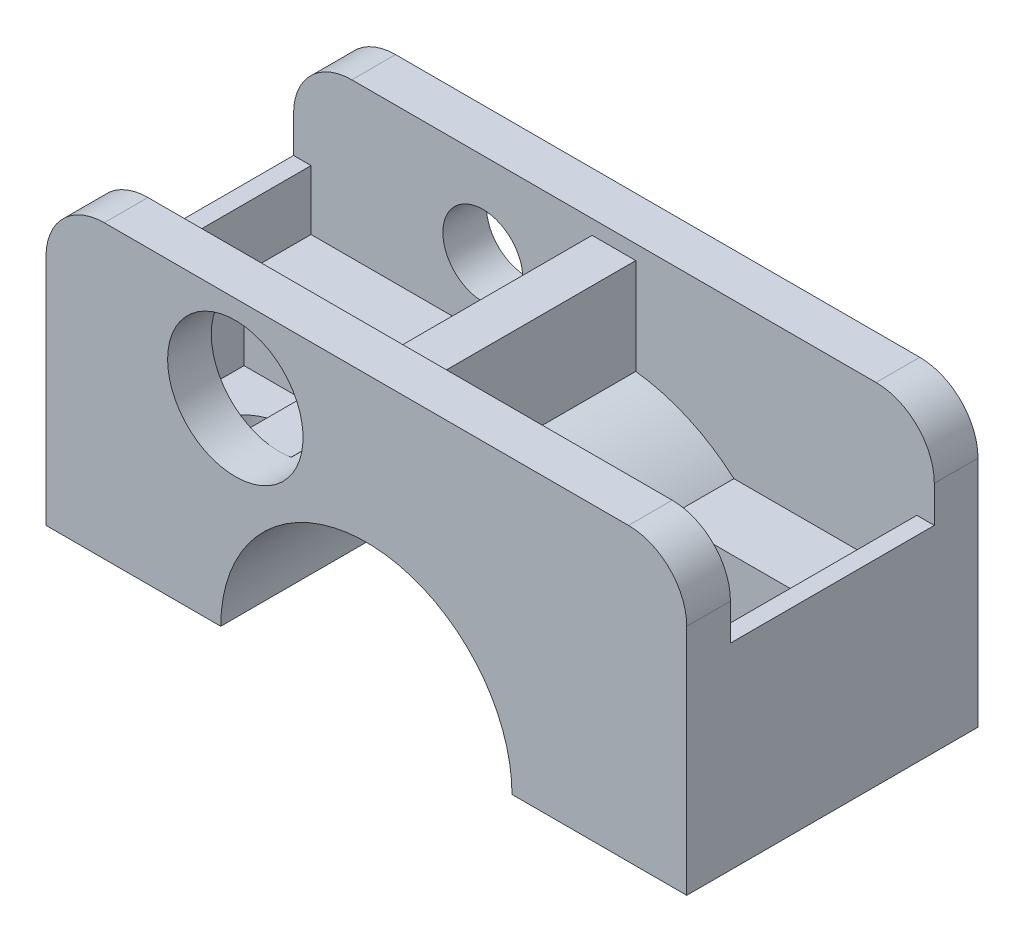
ISO-10303-21;
HEADER;
FILE_DESCRIPTION(('STEP AP214'),'2;1');
FILE_NAME('part.step','',(''),(''),'','','');
FILE_SCHEMA(('AUTOMOTIVE_DESIGN { 1 0 10303 214 1 1 1 1 }'));
ENDSEC;
DATA;
#1=APPLICATION_CONTEXT('core data for automotive mechanical design processes');
#2=APPLICATION_PROTOCOL_DEFINITION('international standard','automotive_design',2000,#1);
#3=PRODUCT_CONTEXT('',#1,'mechanical');
#4=PRODUCT('Part','Part','',(#3));
#5=PRODUCT_RELATED_PRODUCT_CATEGORY('part','',(#4));
#6=PRODUCT_DEFINITION_FORMATION('','',#4);
#7=PRODUCT_DEFINITION_CONTEXT('part definition',#1,'design');
#8=PRODUCT_DEFINITION('design','',#6,#7);
#9=PRODUCT_DEFINITION_SHAPE('','',#8);
#10=(LENGTH_UNIT() NAMED_UNIT(*) SI_UNIT(.MILLI.,.METRE.));
#11=(NAMED_UNIT(*) PLANE_ANGLE_UNIT() SI_UNIT($,.RADIAN.));
#12=(NAMED_UNIT(*) SI_UNIT($,.STERADIAN.) SOLID_ANGLE_UNIT());
#13=UNCERTAINTY_MEASURE_WITH_UNIT(LENGTH_MEASURE(1.E-05),#10,'distance_accuracy_value','');
#14=(GEOMETRIC_REPRESENTATION_CONTEXT(3) GLOBAL_UNCERTAINTY_ASSIGNED_CONTEXT((#13)) GLOBAL_UNIT_ASSIGNED_CONTEXT((#10,
#11,#12)) REPRESENTATION_CONTEXT('',''));
#15=CARTESIAN_POINT('',(0.,0.,0.));
#16=DIRECTION('',(0.,0.,1.));
#17=DIRECTION('',(1.,0.,0.));
#18=AXIS2_PLACEMENT_3D('',#15,#16,#17);
#19=CARTESIAN_POINT('',(0.,15.1140334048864,7.));
#20=DIRECTION('',(0.,0.,1.));
#21=DIRECTION('',(1.,0.,0.));
#22=AXIS2_PLACEMENT_3D('',#19,#20,#21);
#23=PLANE('',#22);
#24=CARTESIAN_POINT('',(0.,0.,7.));
#25=DIRECTION('',(0.,0.,1.));
#26=DIRECTION('',(1.,0.,0.));
#27=AXIS2_PLACEMENT_3D('',#24,#25,#26);
#28=CIRCLE('',#27,12.5);
#29=CARTESIAN_POINT('',(-8.23953882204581,9.39999999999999,7.));
#30=VERTEX_POINT('',#29);
#31=CARTESIAN_POINT('',(-8.14909297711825,9.47851695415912,7.));
#32=VERTEX_POINT('',#31);
#33=EDGE_CURVE('E221',#30,#32,#28,.F.);
#34=ORIENTED_EDGE('',*,*,#33,.F.);
#35=DIRECTION('',(1.,0.,0.));
#36=VECTOR('',#35,1.);
#37=CARTESIAN_POINT('',(-8.23953882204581,9.39999999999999,7.));
#38=LINE('',#37,#36);
#39=CARTESIAN_POINT('',(-9.,9.39999999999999,7.));
#40=VERTEX_POINT('',#39);
#41=EDGE_CURVE('E254',#30,#40,#38,.F.);
#42=ORIENTED_EDGE('',*,*,#41,.T.);
#43=CARTESIAN_POINT('',(-9.,14.05,7.));
#44=DIRECTION('',(0.,0.,-1.));
#45=DIRECTION('',(-1.,0.,0.));
#46=AXIS2_PLACEMENT_3D('',#43,#44,#45);
#47=CIRCLE('',#46,4.65);
#48=EDGE_CURVE('E340',#40,#32,#47,.F.);
#49=ORIENTED_EDGE('',*,*,#48,.T.);
#50=EDGE_LOOP('',(#34,#42,#49));
#51=FACE_BOUND('',#50,.T.);
#52=ADVANCED_FACE('F15',(#51),#23,.F.);
#53=CARTESIAN_POINT('',(0.,0.,-7.));
#54=DIRECTION('',(0.,0.,1.));
#55=DIRECTION('',(1.,0.,0.));
#56=AXIS2_PLACEMENT_3D('',#53,#54,#55);
#57=CYLINDRICAL_SURFACE('',#56,12.5);
#58=DIRECTION('',(0.,0.,-1.));
#59=VECTOR('',#58,1.);
#60=CARTESIAN_POINT('',(-8.23953882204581,9.39999999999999,-7.));
#61=LINE('',#60,#59);
#62=CARTESIAN_POINT('',(-8.23953882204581,9.39999999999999,-7.));
#63=VERTEX_POINT('',#62);
#64=EDGE_CURVE('E253',#63,#30,#61,.F.);
#65=ORIENTED_EDGE('',*,*,#64,.T.);
#66=ORIENTED_EDGE('',*,*,#33,.T.);
#67=DIRECTION('',(0.,0.,-1.));
#68=VECTOR('',#67,1.);
#69=CARTESIAN_POINT('',(-8.14909297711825,9.47851695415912,10.));
#70=LINE('',#69,#68);
#71=CARTESIAN_POINT('',(-8.14909297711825,9.47851695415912,-7.));
#72=VERTEX_POINT('',#71);
#73=EDGE_CURVE('E342',#32,#72,#70,.T.);
#74=ORIENTED_EDGE('',*,*,#73,.T.);
#75=CARTESIAN_POINT('',(0.,0.,-7.));
#76=DIRECTION('',(0.,0.,1.));
#77=DIRECTION('',(1.,0.,0.));
#78=AXIS2_PLACEMENT_3D('',#75,#76,#77);
#79=CIRCLE('',#78,12.5);
#80=EDGE_CURVE('E18',#72,#63,#79,.T.);
#81=ORIENTED_EDGE('',*,*,#80,.T.);
#82=EDGE_LOOP('',(#65,#66,#74,#81));
#83=FACE_BOUND('',#82,.T.);
#84=ADVANCED_FACE('F345',(#83),#57,.T.);
#85=CARTESIAN_POINT('',(20.8,9.39999999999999,-2.4));
#86=DIRECTION('',(0.,0.,-1.));
#87=DIRECTION('',(-1.,0.,0.));
#88=AXIS2_PLACEMENT_3D('',#85,#86,#87);
#89=PLANE('',#88);
#90=DIRECTION('',(0.,1.,0.));
#91=VECTOR('',#90,1.);
#92=CARTESIAN_POINT('',(20.8,13.5,-2.4));
#93=LINE('',#92,#91);
#94=CARTESIAN_POINT('',(20.8,3.89999999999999,-2.4));
#95=VERTEX_POINT('',#94);
#96=CARTESIAN_POINT('',(20.8,9.39999999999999,-2.4));
#97=VERTEX_POINT('',#96);
#98=EDGE_CURVE('E236',#95,#97,#93,.T.);
#99=ORIENTED_EDGE('',*,*,#98,.T.);
#100=DIRECTION('',(1.,0.,0.));
#101=VECTOR('',#100,1.);
#102=CARTESIAN_POINT('',(20.8,9.39999999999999,-2.4));
#103=LINE('',#102,#101);
#104=CARTESIAN_POINT('',(11.4,9.39999999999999,-2.4));
#105=VERTEX_POINT('',#104);
#106=EDGE_CURVE('E227',#97,#105,#103,.F.);
#107=ORIENTED_EDGE('',*,*,#106,.T.);
#108=DIRECTION('',(0.,1.,0.));
#109=VECTOR('',#108,1.);
#110=CARTESIAN_POINT('',(11.4,9.39999999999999,-2.4));
#111=LINE('',#110,#109);
#112=CARTESIAN_POINT('',(11.4,3.89999999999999,-2.4));
#113=VERTEX_POINT('',#112);
#114=EDGE_CURVE('E211',#105,#113,#111,.F.);
#115=ORIENTED_EDGE('',*,*,#114,.T.);
#116=DIRECTION('',(1.,0.,0.));
#117=VECTOR('',#116,1.);
#118=CARTESIAN_POINT('',(16.1,3.89999999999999,-2.4));
#119=LINE('',#118,#117);
#120=EDGE_CURVE('E248',#95,#113,#119,.F.);
#121=ORIENTED_EDGE('',*,*,#120,.F.);
#122=EDGE_LOOP('',(#99,#107,#115,#121));
#123=FACE_BOUND('',#122,.T.);
#124=ADVANCED_FACE('F234',(#123),#89,.F.);
#125=CARTESIAN_POINT('',(-11.4,9.39999999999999,-2.4));
#126=DIRECTION('',(0.,0.,-1.));
#127=DIRECTION('',(-1.,0.,0.));
#128=AXIS2_PLACEMENT_3D('',#125,#126,#127);
#129=PLANE('',#128);
#130=DIRECTION('',(0.,1.,0.));
#131=VECTOR('',#130,1.);
#132=CARTESIAN_POINT('',(-11.4,9.39999999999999,-2.4));
#133=LINE('',#132,#131);
#134=CARTESIAN_POINT('',(-11.4,3.89999999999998,-2.4));
#135=VERTEX_POINT('',#134);
#136=CARTESIAN_POINT('',(-11.4,9.39999999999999,-2.4));
#137=VERTEX_POINT('',#136);
#138=EDGE_CURVE('E220',#135,#137,#133,.T.);
#139=ORIENTED_EDGE('',*,*,#138,.T.);
#140=DIRECTION('',(1.,0.,0.));
#141=VECTOR('',#140,1.);
#142=CARTESIAN_POINT('',(-8.23953882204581,9.39999999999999,-2.4));
#143=LINE('',#142,#141);
#144=CARTESIAN_POINT('',(-20.8,9.39999999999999,-2.4));
#145=VERTEX_POINT('',#144);
#146=EDGE_CURVE('E343',#137,#145,#143,.F.);
#147=ORIENTED_EDGE('',*,*,#146,.T.);
#148=DIRECTION('',(0.,1.,0.));
#149=VECTOR('',#148,1.);
#150=CARTESIAN_POINT('',(-20.8,9.39999999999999,-2.4));
#151=LINE('',#150,#149);
#152=CARTESIAN_POINT('',(-20.8,3.89999999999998,-2.4));
#153=VERTEX_POINT('',#152);
#154=EDGE_CURVE('E445',#145,#153,#151,.F.);
#155=ORIENTED_EDGE('',*,*,#154,.T.);
#156=DIRECTION('',(1.,0.,0.));
#157=VECTOR('',#156,1.);
#158=CARTESIAN_POINT('',(-16.1,3.89999999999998,-2.4));
#159=LINE('',#158,#157);
#160=EDGE_CURVE('E249',#135,#153,#159,.F.);
#161=ORIENTED_EDGE('',*,*,#160,.F.);
#162=EDGE_LOOP('',(#139,#147,#155,#161));
#163=FACE_BOUND('',#162,.T.);
#164=ADVANCED_FACE('F461',(#163),#129,.F.);
#165=CARTESIAN_POINT('',(11.4,9.39999999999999,-2.4));
#166=DIRECTION('',(-1.,0.,0.));
#167=DIRECTION('',(0.,0.,1.));
#168=AXIS2_PLACEMENT_3D('',#165,#166,#167);
#169=PLANE('',#168);
#170=ORIENTED_EDGE('',*,*,#114,.F.);
#171=DIRECTION('',(0.,0.,-1.));
#172=VECTOR('',#171,1.);
#173=CARTESIAN_POINT('',(11.4,9.39999999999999,-7.));
#174=LINE('',#173,#172);
#175=CARTESIAN_POINT('',(11.4,9.39999999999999,7.));
#176=VERTEX_POINT('',#175);
#177=EDGE_CURVE('E215',#105,#176,#174,.F.);
#178=ORIENTED_EDGE('',*,*,#177,.T.);
#179=DIRECTION('',(0.,1.,0.));
#180=VECTOR('',#179,1.);
#181=CARTESIAN_POINT('',(11.4,15.1140334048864,7.));
#182=LINE('',#181,#180);
#183=CARTESIAN_POINT('',(11.4,3.89999999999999,7.));
#184=VERTEX_POINT('',#183);
#185=EDGE_CURVE('E382',#176,#184,#182,.F.);
#186=ORIENTED_EDGE('',*,*,#185,.T.);
#187=DIRECTION('',(0.,0.,1.));
#188=VECTOR('',#187,1.);
#189=CARTESIAN_POINT('',(11.4,3.89999999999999,2.3));
#190=LINE('',#189,#188);
#191=EDGE_CURVE('E217',#113,#184,#190,.T.);
#192=ORIENTED_EDGE('',*,*,#191,.F.);
#193=EDGE_LOOP('',(#170,#178,#186,#192));
#194=FACE_BOUND('',#193,.T.);
#195=ADVANCED_FACE('F213',(#194),#169,.F.);
#196=CARTESIAN_POINT('',(-11.4,9.39999999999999,7.));
#197=DIRECTION('',(1.,0.,0.));
#198=DIRECTION('',(0.,0.,-1.));
#199=AXIS2_PLACEMENT_3D('',#196,#197,#198);
#200=PLANE('',#199);
#201=DIRECTION('',(0.,1.,0.));
#202=VECTOR('',#201,1.);
#203=CARTESIAN_POINT('',(-11.4,15.1140334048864,7.));
#204=LINE('',#203,#202);
#205=CARTESIAN_POINT('',(-11.4,3.89999999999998,7.));
#206=VERTEX_POINT('',#205);
#207=CARTESIAN_POINT('',(-11.4,9.39999999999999,7.));
#208=VERTEX_POINT('',#207);
#209=EDGE_CURVE('E371',#206,#208,#204,.T.);
#210=ORIENTED_EDGE('',*,*,#209,.T.);
#211=DIRECTION('',(0.,0.,-1.));
#212=VECTOR('',#211,1.);
#213=CARTESIAN_POINT('',(-11.4,9.39999999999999,-7.));
#214=LINE('',#213,#212);
#215=EDGE_CURVE('E359',#208,#137,#214,.T.);
#216=ORIENTED_EDGE('',*,*,#215,.T.);
#217=ORIENTED_EDGE('',*,*,#138,.F.);
#218=DIRECTION('',(0.,0.,1.));
#219=VECTOR('',#218,1.);
#220=CARTESIAN_POINT('',(-11.4,3.89999999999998,2.3));
#221=LINE('',#220,#219);
#222=EDGE_CURVE('E252',#206,#135,#221,.F.);
#223=ORIENTED_EDGE('',*,*,#222,.F.);
#224=EDGE_LOOP('',(#210,#216,#217,#223));
#225=FACE_BOUND('',#224,.T.);
#226=ADVANCED_FACE('F707',(#225),#200,.F.);
#227=CARTESIAN_POINT('',(-16.1,3.89999999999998,2.3));
#228=DIRECTION('',(0.,1.,0.));
#229=DIRECTION('',(0.,0.,1.));
#230=AXIS2_PLACEMENT_3D('',#227,#228,#229);
#231=PLANE('',#230);
#232=CARTESIAN_POINT('',(-16.,3.89999999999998,2.5));
#233=DIRECTION('',(0.,1.,0.));
#234=DIRECTION('',(-1.,0.,0.));
#235=AXIS2_PLACEMENT_3D('',#232,#233,#234);
#236=CIRCLE('',#235,2.725);
#237=CARTESIAN_POINT('',(-18.725,3.89999999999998,2.5));
#238=VERTEX_POINT('',#237);
#239=EDGE_CURVE('E314',#238,#238,#236,.F.);
#240=ORIENTED_EDGE('',*,*,#239,.T.);
#241=EDGE_LOOP('',(#240));
#242=FACE_BOUND('',#241,.T.);
#243=DIRECTION('',(0.,0.,1.));
#244=VECTOR('',#243,1.);
#245=CARTESIAN_POINT('',(-20.8,3.89999999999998,-7.));
#246=LINE('',#245,#244);
#247=CARTESIAN_POINT('',(-20.8,3.89999999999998,7.));
#248=VERTEX_POINT('',#247);
#249=EDGE_CURVE('E416',#153,#248,#246,.T.);
#250=ORIENTED_EDGE('',*,*,#249,.T.);
#251=DIRECTION('',(1.,0.,0.));
#252=VECTOR('',#251,1.);
#253=CARTESIAN_POINT('',(0.,3.89999999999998,7.));
#254=LINE('',#253,#252);
#255=EDGE_CURVE('E373',#248,#206,#254,.T.);
#256=ORIENTED_EDGE('',*,*,#255,.T.);
#257=ORIENTED_EDGE('',*,*,#222,.T.);
#258=ORIENTED_EDGE('',*,*,#160,.T.);
#259=EDGE_LOOP('',(#250,#256,#257,#258));
#260=FACE_BOUND('',#259,.T.);
#261=ADVANCED_FACE('F704',(#242,#260),#231,.T.);
#262=CARTESIAN_POINT('',(-18.,20.,0.));
#263=DIRECTION('',(0.,1.,0.));
#264=DIRECTION('',(0.,0.,1.));
#265=AXIS2_PLACEMENT_3D('',#262,#263,#264);
#266=PLANE('',#265);
#267=DIRECTION('',(1.,0.,0.));
#268=VECTOR('',#267,1.);
#269=CARTESIAN_POINT('',(0.,20.,10.));
#270=LINE('',#269,#268);
#271=CARTESIAN_POINT('',(18.,20.,10.));
#272=VERTEX_POINT('',#271);
#273=CARTESIAN_POINT('',(-18.,20.,10.));
#274=VERTEX_POINT('',#273);
#275=EDGE_CURVE('E310',#272,#274,#270,.F.);
#276=ORIENTED_EDGE('',*,*,#275,.F.);
#277=DIRECTION('',(0.,0.,1.));
#278=VECTOR('',#277,1.);
#279=CARTESIAN_POINT('',(18.,20.,0.));
#280=LINE('',#279,#278);
#281=CARTESIAN_POINT('',(18.,20.,7.));
#282=VERTEX_POINT('',#281);
#283=EDGE_CURVE('E339',#282,#272,#280,.T.);
#284=ORIENTED_EDGE('',*,*,#283,.F.);
#285=DIRECTION('',(1.,0.,0.));
#286=VECTOR('',#285,1.);
#287=CARTESIAN_POINT('',(0.,20.,7.));
#288=LINE('',#287,#286);
#289=CARTESIAN_POINT('',(-18.,20.,7.));
#290=VERTEX_POINT('',#289);
#291=EDGE_CURVE('E329',#282,#290,#288,.F.);
#292=ORIENTED_EDGE('',*,*,#291,.T.);
#293=DIRECTION('',(0.,0.,1.));
#294=VECTOR('',#293,1.);
#295=CARTESIAN_POINT('',(-18.,20.,0.));
#296=LINE('',#295,#294);
#297=EDGE_CURVE('E317',#274,#290,#296,.F.);
#298=ORIENTED_EDGE('',*,*,#297,.F.);
#299=EDGE_LOOP('',(#276,#284,#292,#298));
#300=FACE_BOUND('',#299,.T.);
#301=ADVANCED_FACE('F700',(#300),#266,.T.);
#302=CARTESIAN_POINT('',(16.1,3.89999999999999,2.3));
#303=DIRECTION('',(0.,1.,0.));
#304=DIRECTION('',(0.,0.,1.));
#305=AXIS2_PLACEMENT_3D('',#302,#303,#304);
#306=PLANE('',#305);
#307=CARTESIAN_POINT('',(16.,3.89999999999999,2.5));
#308=DIRECTION('',(0.,1.,0.));
#309=DIRECTION('',(-1.,0.,0.));
#310=AXIS2_PLACEMENT_3D('',#307,#308,#309);
#311=CIRCLE('',#310,2.725);
#312=CARTESIAN_POINT('',(13.275,3.89999999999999,2.5));
#313=VERTEX_POINT('',#312);
#314=EDGE_CURVE('E302',#313,#313,#311,.F.);
#315=ORIENTED_EDGE('',*,*,#314,.T.);
#316=EDGE_LOOP('',(#315));
#317=FACE_BOUND('',#316,.T.);
#318=DIRECTION('',(1.,0.,0.));
#319=VECTOR('',#318,1.);
#320=CARTESIAN_POINT('',(0.,3.89999999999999,7.));
#321=LINE('',#320,#319);
#322=CARTESIAN_POINT('',(20.8,3.89999999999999,7.));
#323=VERTEX_POINT('',#322);
#324=EDGE_CURVE('E448',#184,#323,#321,.T.);
#325=ORIENTED_EDGE('',*,*,#324,.T.);
#326=DIRECTION('',(0.,0.,-1.));
#327=VECTOR('',#326,1.);
#328=CARTESIAN_POINT('',(20.8,3.89999999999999,-7.));
#329=LINE('',#328,#327);
#330=EDGE_CURVE('E231',#323,#95,#329,.T.);
#331=ORIENTED_EDGE('',*,*,#330,.T.);
#332=ORIENTED_EDGE('',*,*,#120,.T.);
#333=ORIENTED_EDGE('',*,*,#191,.T.);
#334=EDGE_LOOP('',(#325,#331,#332,#333));
#335=FACE_BOUND('',#334,.T.);
#336=ADVANCED_FACE('F495',(#317,#335),#306,.T.);
#337=CARTESIAN_POINT('',(-8.23953882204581,9.39999999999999,-7.));
#338=DIRECTION('',(0.,-1.,0.));
#339=DIRECTION('',(0.,0.,-1.));
#340=AXIS2_PLACEMENT_3D('',#337,#338,#339);
#341=PLANE('',#340);
#342=ORIENTED_EDGE('',*,*,#215,.F.);
#343=DIRECTION('',(1.,0.,0.));
#344=VECTOR('',#343,1.);
#345=CARTESIAN_POINT('',(0.,9.39999999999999,7.));
#346=LINE('',#345,#344);
#347=EDGE_CURVE('E325',#208,#40,#346,.T.);
#348=ORIENTED_EDGE('',*,*,#347,.T.);
#349=ORIENTED_EDGE('',*,*,#41,.F.);
#350=ORIENTED_EDGE('',*,*,#64,.F.);
#351=DIRECTION('',(1.,0.,0.));
#352=VECTOR('',#351,1.);
#353=CARTESIAN_POINT('',(0.,9.39999999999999,-7.));
#354=LINE('',#353,#352);
#355=CARTESIAN_POINT('',(-20.8,9.39999999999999,-7.));
#356=VERTEX_POINT('',#355);
#357=EDGE_CURVE('E244',#356,#63,#354,.T.);
#358=ORIENTED_EDGE('',*,*,#357,.F.);
#359=DIRECTION('',(0.,0.,1.));
#360=VECTOR('',#359,1.);
#361=CARTESIAN_POINT('',(-20.8,9.39999999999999,-7.));
#362=LINE('',#361,#360);
#363=EDGE_CURVE('E161',#356,#145,#362,.T.);
#364=ORIENTED_EDGE('',*,*,#363,.T.);
#365=ORIENTED_EDGE('',*,*,#146,.F.);
#366=EDGE_LOOP('',(#342,#348,#349,#350,#358,#364,#365));
#367=FACE_BOUND('',#366,.T.);
#368=ADVANCED_FACE('F368',(#367),#341,.F.);
#369=CARTESIAN_POINT('',(-9.,14.05,10.));
#370=DIRECTION('',(0.,0.,-1.));
#371=DIRECTION('',(-1.,0.,0.));
#372=AXIS2_PLACEMENT_3D('',#369,#370,#371);
#373=CYLINDRICAL_SURFACE('',#372,4.65);
#374=CARTESIAN_POINT('',(-9.,14.05,-7.));
#375=DIRECTION('',(0.,0.,-1.));
#376=DIRECTION('',(-1.,0.,0.));
#377=AXIS2_PLACEMENT_3D('',#374,#375,#376);
#378=CIRCLE('',#377,4.65);
#379=CARTESIAN_POINT('',(-5.20305005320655,11.3656618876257,-7.));
#380=VERTEX_POINT('',#379);
#381=EDGE_CURVE('E300',#72,#380,#378,.F.);
#382=ORIENTED_EDGE('',*,*,#381,.F.);
#383=ORIENTED_EDGE('',*,*,#73,.F.);
#384=ORIENTED_EDGE('',*,*,#48,.F.);
#385=CARTESIAN_POINT('',(-9.,14.05,7.));
#386=DIRECTION('',(0.,0.,-1.));
#387=DIRECTION('',(-1.,0.,0.));
#388=AXIS2_PLACEMENT_3D('',#385,#386,#387);
#389=CIRCLE('',#388,4.65);
#390=CARTESIAN_POINT('',(-5.20305005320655,11.3656618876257,7.));
#391=VERTEX_POINT('',#390);
#392=EDGE_CURVE('E321',#40,#391,#389,.T.);
#393=ORIENTED_EDGE('',*,*,#392,.T.);
#394=DIRECTION('',(0.,0.,1.));
#395=VECTOR('',#394,1.);
#396=CARTESIAN_POINT('',(-5.20305005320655,11.3656618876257,-7.));
#397=LINE('',#396,#395);
#398=EDGE_CURVE('E354',#380,#391,#397,.T.);
#399=ORIENTED_EDGE('',*,*,#398,.F.);
#400=EDGE_LOOP('',(#382,#383,#384,#393,#399));
#401=FACE_BOUND('',#400,.T.);
#402=CARTESIAN_POINT('',(-9.,14.05,10.));
#403=DIRECTION('',(0.,0.,-1.));
#404=DIRECTION('',(-1.,0.,0.));
#405=AXIS2_PLACEMENT_3D('',#402,#403,#404);
#406=CIRCLE('',#405,4.65);
#407=CARTESIAN_POINT('',(-13.65,14.05,10.));
#408=VERTEX_POINT('',#407);
#409=EDGE_CURVE('E305',#408,#408,#406,.T.);
#410=ORIENTED_EDGE('',*,*,#409,.F.);
#411=EDGE_LOOP('',(#410));
#412=FACE_BOUND('',#411,.T.);
#413=ADVANCED_FACE('F351',(#401,#412),#373,.F.);
#414=CARTESIAN_POINT('',(0.,0.,-7.));
#415=DIRECTION('',(0.,0.,1.));
#416=DIRECTION('',(1.,0.,0.));
#417=AXIS2_PLACEMENT_3D('',#414,#415,#416);
#418=CYLINDRICAL_SURFACE('',#417,12.5);
#419=DIRECTION('',(0.,0.,-1.));
#420=VECTOR('',#419,1.);
#421=CARTESIAN_POINT('',(-1.5,12.4096736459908,-7.));
#422=LINE('',#421,#420);
#423=CARTESIAN_POINT('',(-1.5,12.4096736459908,7.));
#424=VERTEX_POINT('',#423);
#425=CARTESIAN_POINT('',(-1.5,12.4096736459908,-7.));
#426=VERTEX_POINT('',#425);
#427=EDGE_CURVE('E429',#424,#426,#422,.T.);
#428=ORIENTED_EDGE('',*,*,#427,.T.);
#429=CARTESIAN_POINT('',(0.,0.,-7.));
#430=DIRECTION('',(0.,0.,1.));
#431=DIRECTION('',(1.,0.,0.));
#432=AXIS2_PLACEMENT_3D('',#429,#430,#431);
#433=CIRCLE('',#432,12.5);
#434=EDGE_CURVE('E297',#380,#426,#433,.F.);
#435=ORIENTED_EDGE('',*,*,#434,.F.);
#436=ORIENTED_EDGE('',*,*,#398,.T.);
#437=CARTESIAN_POINT('',(0.,0.,7.));
#438=DIRECTION('',(0.,0.,1.));
#439=DIRECTION('',(1.,0.,0.));
#440=AXIS2_PLACEMENT_3D('',#437,#438,#439);
#441=CIRCLE('',#440,12.5);
#442=EDGE_CURVE('E335',#391,#424,#441,.F.);
#443=ORIENTED_EDGE('',*,*,#442,.T.);
#444=EDGE_LOOP('',(#428,#435,#436,#443));
#445=FACE_BOUND('',#444,.T.);
#446=ADVANCED_FACE('F514',(#445),#418,.T.);
#447=CARTESIAN_POINT('',(-1.5,19.,-7.));
#448=DIRECTION('',(1.,0.,0.));
#449=DIRECTION('',(0.,0.,-1.));
#450=AXIS2_PLACEMENT_3D('',#447,#448,#449);
#451=PLANE('',#450);
#452=DIRECTION('',(0.,0.,-1.));
#453=VECTOR('',#452,1.);
#454=CARTESIAN_POINT('',(-1.5,19.,-7.));
#455=LINE('',#454,#453);
#456=CARTESIAN_POINT('',(-1.5,19.,7.));
#457=VERTEX_POINT('',#456);
#458=CARTESIAN_POINT('',(-1.5,19.,-7.));
#459=VERTEX_POINT('',#458);
#460=EDGE_CURVE('E424',#457,#459,#455,.T.);
#461=ORIENTED_EDGE('',*,*,#460,.T.);
#462=DIRECTION('',(0.,1.,0.));
#463=VECTOR('',#462,1.);
#464=CARTESIAN_POINT('',(-1.5,15.1140334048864,-7.));
#465=LINE('',#464,#463);
#466=EDGE_CURVE('E299',#426,#459,#465,.T.);
#467=ORIENTED_EDGE('',*,*,#466,.F.);
#468=ORIENTED_EDGE('',*,*,#427,.F.);
#469=DIRECTION('',(0.,1.,0.));
#470=VECTOR('',#469,1.);
#471=CARTESIAN_POINT('',(-1.5,15.1140334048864,7.));
#472=LINE('',#471,#470);
#473=EDGE_CURVE('E338',#424,#457,#472,.T.);
#474=ORIENTED_EDGE('',*,*,#473,.T.);
#475=EDGE_LOOP('',(#461,#467,#468,#474));
#476=FACE_BOUND('',#475,.T.);
#477=ADVANCED_FACE('F512',(#476),#451,.F.);
#478=CARTESIAN_POINT('',(1.5,19.,-7.));
#479=DIRECTION('',(0.,-1.,0.));
#480=DIRECTION('',(0.,0.,-1.));
#481=AXIS2_PLACEMENT_3D('',#478,#479,#480);
#482=PLANE('',#481);
#483=DIRECTION('',(0.,0.,1.));
#484=VECTOR('',#483,1.);
#485=CARTESIAN_POINT('',(1.5,19.,-7.));
#486=LINE('',#485,#484);
#487=CARTESIAN_POINT('',(1.5,19.,7.));
#488=VERTEX_POINT('',#487);
#489=CARTESIAN_POINT('',(1.5,19.,-7.));
#490=VERTEX_POINT('',#489);
#491=EDGE_CURVE('E421',#488,#490,#486,.F.);
#492=ORIENTED_EDGE('',*,*,#491,.T.);
#493=DIRECTION('',(1.,0.,0.));
#494=VECTOR('',#493,1.);
#495=CARTESIAN_POINT('',(0.,19.,-7.));
#496=LINE('',#495,#494);
#497=EDGE_CURVE('E425',#459,#490,#496,.T.);
#498=ORIENTED_EDGE('',*,*,#497,.F.);
#499=ORIENTED_EDGE('',*,*,#460,.F.);
#500=DIRECTION('',(1.,0.,0.));
#501=VECTOR('',#500,1.);
#502=CARTESIAN_POINT('',(0.,19.,7.));
#503=LINE('',#502,#501);
#504=EDGE_CURVE('E385',#457,#488,#503,.T.);
#505=ORIENTED_EDGE('',*,*,#504,.T.);
#506=EDGE_LOOP('',(#492,#498,#499,#505));
#507=FACE_BOUND('',#506,.T.);
#508=ADVANCED_FACE('F508',(#507),#482,.F.);
#509=CARTESIAN_POINT('',(1.5,12.4096736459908,-7.));
#510=DIRECTION('',(-1.,0.,0.));
#511=DIRECTION('',(0.,0.,1.));
#512=AXIS2_PLACEMENT_3D('',#509,#510,#511);
#513=PLANE('',#512);
#514=DIRECTION('',(0.,0.,1.));
#515=VECTOR('',#514,1.);
#516=CARTESIAN_POINT('',(1.5,12.4096736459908,-7.));
#517=LINE('',#516,#515);
#518=CARTESIAN_POINT('',(1.5,12.4096736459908,-7.));
#519=VERTEX_POINT('',#518);
#520=CARTESIAN_POINT('',(1.5,12.4096736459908,7.));
#521=VERTEX_POINT('',#520);
#522=EDGE_CURVE('E240',#519,#521,#517,.T.);
#523=ORIENTED_EDGE('',*,*,#522,.F.);
#524=DIRECTION('',(0.,1.,0.));
#525=VECTOR('',#524,1.);
#526=CARTESIAN_POINT('',(1.5,15.1140334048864,-7.));
#527=LINE('',#526,#525);
#528=EDGE_CURVE('E296',#490,#519,#527,.F.);
#529=ORIENTED_EDGE('',*,*,#528,.F.);
#530=ORIENTED_EDGE('',*,*,#491,.F.);
#531=DIRECTION('',(0.,1.,0.));
#532=VECTOR('',#531,1.);
#533=CARTESIAN_POINT('',(1.5,15.1140334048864,7.));
#534=LINE('',#533,#532);
#535=EDGE_CURVE('E334',#488,#521,#534,.F.);
#536=ORIENTED_EDGE('',*,*,#535,.T.);
#537=EDGE_LOOP('',(#523,#529,#530,#536));
#538=FACE_BOUND('',#537,.T.);
#539=ADVANCED_FACE('F505',(#538),#513,.F.);
#540=CARTESIAN_POINT('',(0.,0.,-7.));
#541=DIRECTION('',(0.,0.,1.));
#542=DIRECTION('',(1.,0.,0.));
#543=AXIS2_PLACEMENT_3D('',#540,#541,#542);
#544=CYLINDRICAL_SURFACE('',#543,12.5);
#545=CARTESIAN_POINT('',(0.,0.,-7.));
#546=DIRECTION('',(0.,0.,1.));
#547=DIRECTION('',(1.,0.,0.));
#548=AXIS2_PLACEMENT_3D('',#545,#546,#547);
#549=CIRCLE('',#548,12.5);
#550=CARTESIAN_POINT('',(8.2395388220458,9.39999999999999,-7.));
#551=VERTEX_POINT('',#550);
#552=EDGE_CURVE('E293',#519,#551,#549,.F.);
#553=ORIENTED_EDGE('',*,*,#552,.F.);
#554=ORIENTED_EDGE('',*,*,#522,.T.);
#555=CARTESIAN_POINT('',(0.,0.,7.));
#556=DIRECTION('',(0.,0.,1.));
#557=DIRECTION('',(1.,0.,0.));
#558=AXIS2_PLACEMENT_3D('',#555,#556,#557);
#559=CIRCLE('',#558,12.5);
#560=CARTESIAN_POINT('',(8.2395388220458,9.39999999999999,7.));
#561=VERTEX_POINT('',#560);
#562=EDGE_CURVE('E331',#521,#561,#559,.F.);
#563=ORIENTED_EDGE('',*,*,#562,.T.);
#564=DIRECTION('',(0.,0.,-1.));
#565=VECTOR('',#564,1.);
#566=CARTESIAN_POINT('',(8.23953882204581,9.39999999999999,-7.));
#567=LINE('',#566,#565);
#568=EDGE_CURVE('E237',#561,#551,#567,.T.);
#569=ORIENTED_EDGE('',*,*,#568,.T.);
#570=EDGE_LOOP('',(#553,#554,#563,#569));
#571=FACE_BOUND('',#570,.T.);
#572=ADVANCED_FACE('F500',(#571),#544,.T.);
#573=CARTESIAN_POINT('',(20.8,9.39999999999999,-7.));
#574=DIRECTION('',(0.,-1.,0.));
#575=DIRECTION('',(0.,0.,-1.));
#576=AXIS2_PLACEMENT_3D('',#573,#574,#575);
#577=PLANE('',#576);
#578=ORIENTED_EDGE('',*,*,#106,.F.);
#579=DIRECTION('',(0.,0.,-1.));
#580=VECTOR('',#579,1.);
#581=CARTESIAN_POINT('',(20.8,9.39999999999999,-7.));
#582=LINE('',#581,#580);
#583=CARTESIAN_POINT('',(20.8,9.39999999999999,-7.));
#584=VERTEX_POINT('',#583);
#585=EDGE_CURVE('E247',#97,#584,#582,.T.);
#586=ORIENTED_EDGE('',*,*,#585,.T.);
#587=DIRECTION('',(1.,0.,0.));
#588=VECTOR('',#587,1.);
#589=CARTESIAN_POINT('',(0.,9.39999999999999,-7.));
#590=LINE('',#589,#588);
#591=EDGE_CURVE('E295',#551,#584,#590,.T.);
#592=ORIENTED_EDGE('',*,*,#591,.F.);
#593=ORIENTED_EDGE('',*,*,#568,.F.);
#594=DIRECTION('',(1.,0.,0.));
#595=VECTOR('',#594,1.);
#596=CARTESIAN_POINT('',(0.,9.39999999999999,7.));
#597=LINE('',#596,#595);
#598=EDGE_CURVE('E230',#561,#176,#597,.T.);
#599=ORIENTED_EDGE('',*,*,#598,.T.);
#600=ORIENTED_EDGE('',*,*,#177,.F.);
#601=EDGE_LOOP('',(#578,#586,#592,#593,#599,#600));
#602=FACE_BOUND('',#601,.T.);
#603=ADVANCED_FACE('F225',(#602),#577,.F.);
#604=CARTESIAN_POINT('',(20.8,13.5,-7.));
#605=DIRECTION('',(1.,0.,0.));
#606=DIRECTION('',(0.,0.,-1.));
#607=AXIS2_PLACEMENT_3D('',#604,#605,#606);
#608=PLANE('',#607);
#609=DIRECTION('',(0.,0.,-1.));
#610=VECTOR('',#609,1.);
#611=CARTESIAN_POINT('',(20.8,13.5,-7.));
#612=LINE('',#611,#610);
#613=CARTESIAN_POINT('',(20.8,13.5,7.));
#614=VERTEX_POINT('',#613);
#615=CARTESIAN_POINT('',(20.8,13.5,-7.));
#616=VERTEX_POINT('',#615);
#617=EDGE_CURVE('E413',#614,#616,#612,.T.);
#618=ORIENTED_EDGE('',*,*,#617,.T.);
#619=DIRECTION('',(0.,1.,0.));
#620=VECTOR('',#619,1.);
#621=CARTESIAN_POINT('',(20.8,15.1140334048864,-7.));
#622=LINE('',#621,#620);
#623=EDGE_CURVE('E409',#584,#616,#622,.T.);
#624=ORIENTED_EDGE('',*,*,#623,.F.);
#625=ORIENTED_EDGE('',*,*,#585,.F.);
#626=ORIENTED_EDGE('',*,*,#98,.F.);
#627=ORIENTED_EDGE('',*,*,#330,.F.);
#628=DIRECTION('',(0.,1.,0.));
#629=VECTOR('',#628,1.);
#630=CARTESIAN_POINT('',(20.8,15.1140334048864,7.));
#631=LINE('',#630,#629);
#632=EDGE_CURVE('E402',#323,#614,#631,.T.);
#633=ORIENTED_EDGE('',*,*,#632,.T.);
#634=EDGE_LOOP('',(#618,#624,#625,#626,#627,#633));
#635=FACE_BOUND('',#634,.T.);
#636=ADVANCED_FACE('F493',(#635),#608,.F.);
#637=CARTESIAN_POINT('',(-20.8,9.39999999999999,-7.));
#638=DIRECTION('',(-1.,0.,0.));
#639=DIRECTION('',(0.,0.,1.));
#640=AXIS2_PLACEMENT_3D('',#637,#638,#639);
#641=PLANE('',#640);
#642=ORIENTED_EDGE('',*,*,#249,.F.);
#643=ORIENTED_EDGE('',*,*,#154,.F.);
#644=ORIENTED_EDGE('',*,*,#363,.F.);
#645=DIRECTION('',(0.,1.,0.));
#646=VECTOR('',#645,1.);
#647=CARTESIAN_POINT('',(-20.8,15.1140334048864,-7.));
#648=LINE('',#647,#646);
#649=CARTESIAN_POINT('',(-20.8,13.5,-7.));
#650=VERTEX_POINT('',#649);
#651=EDGE_CURVE('E394',#650,#356,#648,.F.);
#652=ORIENTED_EDGE('',*,*,#651,.F.);
#653=DIRECTION('',(0.,0.,-1.));
#654=VECTOR('',#653,1.);
#655=CARTESIAN_POINT('',(-20.8,13.5,-7.));
#656=LINE('',#655,#654);
#657=CARTESIAN_POINT('',(-20.8,13.5,7.));
#658=VERTEX_POINT('',#657);
#659=EDGE_CURVE('E324',#650,#658,#656,.F.);
#660=ORIENTED_EDGE('',*,*,#659,.T.);
#661=DIRECTION('',(0.,1.,0.));
#662=VECTOR('',#661,1.);
#663=CARTESIAN_POINT('',(-20.8,15.1140334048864,7.));
#664=LINE('',#663,#662);
#665=EDGE_CURVE('E380',#658,#248,#664,.F.);
#666=ORIENTED_EDGE('',*,*,#665,.T.);
#667=EDGE_LOOP('',(#642,#643,#644,#652,#660,#666));
#668=FACE_BOUND('',#667,.T.);
#669=ADVANCED_FACE('F464',(#668),#641,.F.);
#670=CARTESIAN_POINT('',(22.,13.5,-7.));
#671=DIRECTION('',(0.,-1.,0.));
#672=DIRECTION('',(0.,0.,-1.));
#673=AXIS2_PLACEMENT_3D('',#670,#671,#672);
#674=PLANE('',#673);
#675=DIRECTION('',(0.,0.,-1.));
#676=VECTOR('',#675,1.);
#677=CARTESIAN_POINT('',(22.,13.5,0.));
#678=LINE('',#677,#676);
#679=CARTESIAN_POINT('',(22.,13.5,-7.));
#680=VERTEX_POINT('',#679);
#681=CARTESIAN_POINT('',(22.,13.5,7.));
#682=VERTEX_POINT('',#681);
#683=EDGE_CURVE('E393',#680,#682,#678,.F.);
#684=ORIENTED_EDGE('',*,*,#683,.F.);
#685=DIRECTION('',(1.,0.,0.));
#686=VECTOR('',#685,1.);
#687=CARTESIAN_POINT('',(0.,13.5,-7.));
#688=LINE('',#687,#686);
#689=EDGE_CURVE('E405',#616,#680,#688,.T.);
#690=ORIENTED_EDGE('',*,*,#689,.F.);
#691=ORIENTED_EDGE('',*,*,#617,.F.);
#692=DIRECTION('',(1.,0.,0.));
#693=VECTOR('',#692,1.);
#694=CARTESIAN_POINT('',(0.,13.5,7.));
#695=LINE('',#694,#693);
#696=EDGE_CURVE('E330',#614,#682,#695,.T.);
#697=ORIENTED_EDGE('',*,*,#696,.T.);
#698=EDGE_LOOP('',(#684,#690,#691,#697));
#699=FACE_BOUND('',#698,.T.);
#700=ADVANCED_FACE('F487',(#699),#674,.F.);
#701=CARTESIAN_POINT('',(18.,16.,0.));
#702=DIRECTION('',(0.,0.,1.));
#703=DIRECTION('',(1.,0.,0.));
#704=AXIS2_PLACEMENT_3D('',#701,#702,#703);
#705=CYLINDRICAL_SURFACE('',#704,3.99999999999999);
#706=CARTESIAN_POINT('',(18.,16.,10.));
#707=DIRECTION('',(0.,0.,1.));
#708=DIRECTION('',(1.,0.,0.));
#709=AXIS2_PLACEMENT_3D('',#706,#707,#708);
#710=CIRCLE('',#709,3.99999999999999);
#711=CARTESIAN_POINT('',(22.,16.,10.));
#712=VERTEX_POINT('',#711);
#713=EDGE_CURVE('E311',#712,#272,#710,.T.);
#714=ORIENTED_EDGE('',*,*,#713,.F.);
#715=DIRECTION('',(0.,0.,-1.));
#716=VECTOR('',#715,1.);
#717=CARTESIAN_POINT('',(22.,16.,0.));
#718=LINE('',#717,#716);
#719=CARTESIAN_POINT('',(22.,16.,7.));
#720=VERTEX_POINT('',#719);
#721=EDGE_CURVE('E395',#720,#712,#718,.F.);
#722=ORIENTED_EDGE('',*,*,#721,.F.);
#723=CARTESIAN_POINT('',(18.,16.,7.));
#724=DIRECTION('',(0.,0.,1.));
#725=DIRECTION('',(1.,0.,0.));
#726=AXIS2_PLACEMENT_3D('',#723,#724,#725);
#727=CIRCLE('',#726,3.99999999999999);
#728=EDGE_CURVE('E326',#720,#282,#727,.T.);
#729=ORIENTED_EDGE('',*,*,#728,.T.);
#730=ORIENTED_EDGE('',*,*,#283,.T.);
#731=EDGE_LOOP('',(#714,#722,#729,#730));
#732=FACE_BOUND('',#731,.T.);
#733=ADVANCED_FACE('F620',(#732),#705,.T.);
#734=CARTESIAN_POINT('',(0.,15.1140334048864,7.));
#735=DIRECTION('',(0.,0.,1.));
#736=DIRECTION('',(1.,0.,0.));
#737=AXIS2_PLACEMENT_3D('',#734,#735,#736);
#738=PLANE('',#737);
#739=ORIENTED_EDGE('',*,*,#347,.F.);
#740=ORIENTED_EDGE('',*,*,#209,.F.);
#741=ORIENTED_EDGE('',*,*,#255,.F.);
#742=ORIENTED_EDGE('',*,*,#665,.F.);
#743=DIRECTION('',(1.,0.,0.));
#744=VECTOR('',#743,1.);
#745=CARTESIAN_POINT('',(-20.8,13.5,7.));
#746=LINE('',#745,#744);
#747=CARTESIAN_POINT('',(-22.,13.5,7.));
#748=VERTEX_POINT('',#747);
#749=EDGE_CURVE('E320',#658,#748,#746,.F.);
#750=ORIENTED_EDGE('',*,*,#749,.T.);
#751=DIRECTION('',(0.,1.,0.));
#752=VECTOR('',#751,1.);
#753=CARTESIAN_POINT('',(-22.,0.,7.));
#754=LINE('',#753,#752);
#755=CARTESIAN_POINT('',(-22.,16.,7.));
#756=VERTEX_POINT('',#755);
#757=EDGE_CURVE('E377',#756,#748,#754,.F.);
#758=ORIENTED_EDGE('',*,*,#757,.F.);
#759=CARTESIAN_POINT('',(-18.,16.,7.));
#760=DIRECTION('',(0.,0.,1.));
#761=DIRECTION('',(1.,0.,0.));
#762=AXIS2_PLACEMENT_3D('',#759,#760,#761);
#763=CIRCLE('',#762,4.);
#764=EDGE_CURVE('E318',#290,#756,#763,.T.);
#765=ORIENTED_EDGE('',*,*,#764,.F.);
#766=ORIENTED_EDGE('',*,*,#291,.F.);
#767=ORIENTED_EDGE('',*,*,#728,.F.);
#768=DIRECTION('',(0.,1.,0.));
#769=VECTOR('',#768,1.);
#770=CARTESIAN_POINT('',(22.,16.,7.));
#771=LINE('',#770,#769);
#772=EDGE_CURVE('E397',#682,#720,#771,.T.);
#773=ORIENTED_EDGE('',*,*,#772,.F.);
#774=ORIENTED_EDGE('',*,*,#696,.F.);
#775=ORIENTED_EDGE('',*,*,#632,.F.);
#776=ORIENTED_EDGE('',*,*,#324,.F.);
#777=ORIENTED_EDGE('',*,*,#185,.F.);
#778=ORIENTED_EDGE('',*,*,#598,.F.);
#779=ORIENTED_EDGE('',*,*,#562,.F.);
#780=ORIENTED_EDGE('',*,*,#535,.F.);
#781=ORIENTED_EDGE('',*,*,#504,.F.);
#782=ORIENTED_EDGE('',*,*,#473,.F.);
#783=ORIENTED_EDGE('',*,*,#442,.F.);
#784=ORIENTED_EDGE('',*,*,#392,.F.);
#785=EDGE_LOOP('',(#739,#740,#741,#742,#750,#758,#765,#766,#767,#773,#774,#775,#776,#777,#778,
#779,#780,#781,#782,#783,#784));
#786=FACE_BOUND('',#785,.T.);
#787=ADVANCED_FACE('F364',(#786),#738,.F.);
#788=CARTESIAN_POINT('',(-20.8,13.5,-7.));
#789=DIRECTION('',(0.,-1.,0.));
#790=DIRECTION('',(0.,0.,-1.));
#791=AXIS2_PLACEMENT_3D('',#788,#789,#790);
#792=PLANE('',#791);
#793=ORIENTED_EDGE('',*,*,#659,.F.);
#794=DIRECTION('',(1.,0.,0.));
#795=VECTOR('',#794,1.);
#796=CARTESIAN_POINT('',(0.,13.5,-7.));
#797=LINE('',#796,#795);
#798=CARTESIAN_POINT('',(-22.,13.5,-7.));
#799=VERTEX_POINT('',#798);
#800=EDGE_CURVE('E408',#799,#650,#797,.T.);
#801=ORIENTED_EDGE('',*,*,#800,.F.);
#802=DIRECTION('',(0.,0.,1.));
#803=VECTOR('',#802,1.);
#804=CARTESIAN_POINT('',(-22.,13.5,0.));
#805=LINE('',#804,#803);
#806=EDGE_CURVE('E536',#748,#799,#805,.F.);
#807=ORIENTED_EDGE('',*,*,#806,.F.);
#808=ORIENTED_EDGE('',*,*,#749,.F.);
#809=EDGE_LOOP('',(#793,#801,#807,#808));
#810=FACE_BOUND('',#809,.T.);
#811=ADVANCED_FACE('F545',(#810),#792,.F.);
#812=CARTESIAN_POINT('',(-18.,16.,0.));
#813=DIRECTION('',(0.,0.,1.));
#814=DIRECTION('',(1.,0.,0.));
#815=AXIS2_PLACEMENT_3D('',#812,#813,#814);
#816=CYLINDRICAL_SURFACE('',#815,4.);
#817=CARTESIAN_POINT('',(-18.,16.,10.));
#818=DIRECTION('',(0.,0.,1.));
#819=DIRECTION('',(1.,0.,0.));
#820=AXIS2_PLACEMENT_3D('',#817,#818,#819);
#821=CIRCLE('',#820,4.);
#822=CARTESIAN_POINT('',(-22.,16.,10.));
#823=VERTEX_POINT('',#822);
#824=EDGE_CURVE('E308',#274,#823,#821,.T.);
#825=ORIENTED_EDGE('',*,*,#824,.F.);
#826=ORIENTED_EDGE('',*,*,#297,.T.);
#827=ORIENTED_EDGE('',*,*,#764,.T.);
#828=DIRECTION('',(0.,0.,1.));
#829=VECTOR('',#828,1.);
#830=CARTESIAN_POINT('',(-22.,16.,0.));
#831=LINE('',#830,#829);
#832=EDGE_CURVE('E527',#823,#756,#831,.F.);
#833=ORIENTED_EDGE('',*,*,#832,.F.);
#834=EDGE_LOOP('',(#825,#826,#827,#833));
#835=FACE_BOUND('',#834,.T.);
#836=ADVANCED_FACE('F614',(#835),#816,.T.);
#837=CARTESIAN_POINT('',(-16.,0.,2.5));
#838=DIRECTION('',(0.,1.,0.));
#839=DIRECTION('',(-1.,0.,0.));
#840=AXIS2_PLACEMENT_3D('',#837,#838,#839);
#841=CYLINDRICAL_SURFACE('',#840,2.725);
#842=CARTESIAN_POINT('',(-16.,0.,2.5));
#843=DIRECTION('',(0.,1.,0.));
#844=DIRECTION('',(-1.,0.,0.));
#845=AXIS2_PLACEMENT_3D('',#842,#843,#844);
#846=CIRCLE('',#845,2.725);
#847=CARTESIAN_POINT('',(-18.725,0.,2.5));
#848=VERTEX_POINT('',#847);
#849=EDGE_CURVE('E281',#848,#848,#846,.T.);
#850=ORIENTED_EDGE('',*,*,#849,.F.);
#851=EDGE_LOOP('',(#850));
#852=FACE_BOUND('',#851,.T.);
#853=ORIENTED_EDGE('',*,*,#239,.F.);
#854=EDGE_LOOP('',(#853));
#855=FACE_BOUND('',#854,.T.);
#856=ADVANCED_FACE('F663',(#852,#855),#841,.F.);
#857=CARTESIAN_POINT('',(0.,10.2123448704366,10.));
#858=DIRECTION('',(0.,0.,1.));
#859=DIRECTION('',(1.,0.,0.));
#860=AXIS2_PLACEMENT_3D('',#857,#858,#859);
#861=PLANE('',#860);
#862=ORIENTED_EDGE('',*,*,#409,.T.);
#863=EDGE_LOOP('',(#862));
#864=FACE_BOUND('',#863,.T.);
#865=ORIENTED_EDGE('',*,*,#824,.T.);
#866=DIRECTION('',(0.,1.,0.));
#867=VECTOR('',#866,1.);
#868=CARTESIAN_POINT('',(-22.,0.,10.));
#869=LINE('',#868,#867);
#870=CARTESIAN_POINT('',(-22.,0.,10.));
#871=VERTEX_POINT('',#870);
#872=EDGE_CURVE('E528',#871,#823,#869,.T.);
#873=ORIENTED_EDGE('',*,*,#872,.F.);
#874=DIRECTION('',(1.,0.,0.));
#875=VECTOR('',#874,1.);
#876=CARTESIAN_POINT('',(-10.,0.,10.));
#877=LINE('',#876,#875);
#878=CARTESIAN_POINT('',(-10.,0.,10.));
#879=VERTEX_POINT('',#878);
#880=EDGE_CURVE('E524',#879,#871,#877,.F.);
#881=ORIENTED_EDGE('',*,*,#880,.F.);
#882=CARTESIAN_POINT('',(0.,0.,10.));
#883=DIRECTION('',(0.,0.,1.));
#884=DIRECTION('',(1.,0.,0.));
#885=AXIS2_PLACEMENT_3D('',#882,#883,#884);
#886=CIRCLE('',#885,10.);
#887=CARTESIAN_POINT('',(10.,0.,10.));
#888=VERTEX_POINT('',#887);
#889=EDGE_CURVE('E276',#879,#888,#886,.F.);
#890=ORIENTED_EDGE('',*,*,#889,.T.);
#891=DIRECTION('',(1.,0.,0.));
#892=VECTOR('',#891,1.);
#893=CARTESIAN_POINT('',(22.,0.,10.));
#894=LINE('',#893,#892);
#895=CARTESIAN_POINT('',(22.,0.,10.));
#896=VERTEX_POINT('',#895);
#897=EDGE_CURVE('E279',#896,#888,#894,.F.);
#898=ORIENTED_EDGE('',*,*,#897,.F.);
#899=DIRECTION('',(0.,1.,0.));
#900=VECTOR('',#899,1.);
#901=CARTESIAN_POINT('',(22.,16.,10.));
#902=LINE('',#901,#900);
#903=EDGE_CURVE('E292',#712,#896,#902,.F.);
#904=ORIENTED_EDGE('',*,*,#903,.F.);
#905=ORIENTED_EDGE('',*,*,#713,.T.);
#906=ORIENTED_EDGE('',*,*,#275,.T.);
#907=EDGE_LOOP('',(#865,#873,#881,#890,#898,#904,#905,#906));
#908=FACE_BOUND('',#907,.T.);
#909=ADVANCED_FACE('F609',(#864,#908),#861,.T.);
#910=CARTESIAN_POINT('',(16.,0.,2.5));
#911=DIRECTION('',(0.,1.,0.));
#912=DIRECTION('',(-1.,0.,0.));
#913=AXIS2_PLACEMENT_3D('',#910,#911,#912);
#914=CYLINDRICAL_SURFACE('',#913,2.725);
#915=CARTESIAN_POINT('',(16.,0.,2.5));
#916=DIRECTION('',(0.,1.,0.));
#917=DIRECTION('',(-1.,0.,0.));
#918=AXIS2_PLACEMENT_3D('',#915,#916,#917);
#919=CIRCLE('',#918,2.725);
#920=CARTESIAN_POINT('',(13.275,0.,2.5));
#921=VERTEX_POINT('',#920);
#922=EDGE_CURVE('E272',#921,#921,#919,.T.);
#923=ORIENTED_EDGE('',*,*,#922,.F.);
#924=EDGE_LOOP('',(#923));
#925=FACE_BOUND('',#924,.T.);
#926=ORIENTED_EDGE('',*,*,#314,.F.);
#927=EDGE_LOOP('',(#926));
#928=FACE_BOUND('',#927,.T.);
#929=ADVANCED_FACE('F650',(#925,#928),#914,.F.);
#930=CARTESIAN_POINT('',(0.,15.1140334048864,-7.));
#931=DIRECTION('',(0.,0.,1.));
#932=DIRECTION('',(1.,0.,0.));
#933=AXIS2_PLACEMENT_3D('',#930,#931,#932);
#934=PLANE('',#933);
#935=CARTESIAN_POINT('',(-9.,14.05,-7.));
#936=DIRECTION('',(0.,0.,1.));
#937=DIRECTION('',(1.,0.,0.));
#938=AXIS2_PLACEMENT_3D('',#935,#936,#937);
#939=CIRCLE('',#938,2.75);
#940=CARTESIAN_POINT('',(-6.25,14.05,-7.));
#941=VERTEX_POINT('',#940);
#942=EDGE_CURVE('E269',#941,#941,#939,.F.);
#943=ORIENTED_EDGE('',*,*,#942,.T.);
#944=EDGE_LOOP('',(#943));
#945=FACE_BOUND('',#944,.T.);
#946=ORIENTED_EDGE('',*,*,#800,.T.);
#947=ORIENTED_EDGE('',*,*,#651,.T.);
#948=ORIENTED_EDGE('',*,*,#357,.T.);
#949=ORIENTED_EDGE('',*,*,#80,.F.);
#950=ORIENTED_EDGE('',*,*,#381,.T.);
#951=ORIENTED_EDGE('',*,*,#434,.T.);
#952=ORIENTED_EDGE('',*,*,#466,.T.);
#953=ORIENTED_EDGE('',*,*,#497,.T.);
#954=ORIENTED_EDGE('',*,*,#528,.T.);
#955=ORIENTED_EDGE('',*,*,#552,.T.);
#956=ORIENTED_EDGE('',*,*,#591,.T.);
#957=ORIENTED_EDGE('',*,*,#623,.T.);
#958=ORIENTED_EDGE('',*,*,#689,.T.);
#959=DIRECTION('',(0.,1.,0.));
#960=VECTOR('',#959,1.);
#961=CARTESIAN_POINT('',(22.,16.,-7.));
#962=LINE('',#961,#960);
#963=CARTESIAN_POINT('',(22.,16.,-7.));
#964=VERTEX_POINT('',#963);
#965=EDGE_CURVE('E390',#964,#680,#962,.F.);
#966=ORIENTED_EDGE('',*,*,#965,.F.);
#967=CARTESIAN_POINT('',(18.,16.,-7.));
#968=DIRECTION('',(0.,0.,1.));
#969=DIRECTION('',(1.,0.,0.));
#970=AXIS2_PLACEMENT_3D('',#967,#968,#969);
#971=CIRCLE('',#970,3.99999999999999);
#972=CARTESIAN_POINT('',(18.,20.,-7.));
#973=VERTEX_POINT('',#972);
#974=EDGE_CURVE('E289',#973,#964,#971,.F.);
#975=ORIENTED_EDGE('',*,*,#974,.F.);
#976=DIRECTION('',(1.,0.,0.));
#977=VECTOR('',#976,1.);
#978=CARTESIAN_POINT('',(-18.,20.,-7.));
#979=LINE('',#978,#977);
#980=CARTESIAN_POINT('',(-18.,20.,-7.));
#981=VERTEX_POINT('',#980);
#982=EDGE_CURVE('E388',#981,#973,#979,.T.);
#983=ORIENTED_EDGE('',*,*,#982,.F.);
#984=CARTESIAN_POINT('',(-18.,16.,-7.));
#985=DIRECTION('',(0.,0.,1.));
#986=DIRECTION('',(1.,0.,0.));
#987=AXIS2_PLACEMENT_3D('',#984,#985,#986);
#988=CIRCLE('',#987,4.);
#989=CARTESIAN_POINT('',(-22.,16.,-7.));
#990=VERTEX_POINT('',#989);
#991=EDGE_CURVE('E285',#990,#981,#988,.F.);
#992=ORIENTED_EDGE('',*,*,#991,.F.);
#993=DIRECTION('',(0.,1.,0.));
#994=VECTOR('',#993,1.);
#995=CARTESIAN_POINT('',(-22.,0.,-7.));
#996=LINE('',#995,#994);
#997=EDGE_CURVE('E534',#799,#990,#996,.T.);
#998=ORIENTED_EDGE('',*,*,#997,.F.);
#999=EDGE_LOOP('',(#946,#947,#948,#949,#950,#951,#952,#953,#954,#955,#956,#957,#958,#966,#975,
#983,#992,#998));
#1000=FACE_BOUND('',#999,.T.);
#1001=ADVANCED_FACE('F467',(#945,#1000),#934,.T.);
#1002=CARTESIAN_POINT('',(22.,16.,0.));
#1003=DIRECTION('',(1.,0.,0.));
#1004=DIRECTION('',(0.,0.,-1.));
#1005=AXIS2_PLACEMENT_3D('',#1002,#1003,#1004);
#1006=PLANE('',#1005);
#1007=DIRECTION('',(0.,1.,0.));
#1008=VECTOR('',#1007,1.);
#1009=CARTESIAN_POINT('',(22.,10.2123448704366,-10.));
#1010=LINE('',#1009,#1008);
#1011=CARTESIAN_POINT('',(22.,0.,-10.));
#1012=VERTEX_POINT('',#1011);
#1013=CARTESIAN_POINT('',(22.,16.,-10.));
#1014=VERTEX_POINT('',#1013);
#1015=EDGE_CURVE('E268',#1012,#1014,#1010,.T.);
#1016=ORIENTED_EDGE('',*,*,#1015,.T.);
#1017=DIRECTION('',(0.,0.,1.));
#1018=VECTOR('',#1017,1.);
#1019=CARTESIAN_POINT('',(22.,16.,0.));
#1020=LINE('',#1019,#1018);
#1021=EDGE_CURVE('E291',#964,#1014,#1020,.F.);
#1022=ORIENTED_EDGE('',*,*,#1021,.F.);
#1023=ORIENTED_EDGE('',*,*,#965,.T.);
#1024=ORIENTED_EDGE('',*,*,#683,.T.);
#1025=ORIENTED_EDGE('',*,*,#772,.T.);
#1026=ORIENTED_EDGE('',*,*,#721,.T.);
#1027=ORIENTED_EDGE('',*,*,#903,.T.);
#1028=DIRECTION('',(0.,0.,-1.));
#1029=VECTOR('',#1028,1.);
#1030=CARTESIAN_POINT('',(22.,0.,0.));
#1031=LINE('',#1030,#1029);
#1032=EDGE_CURVE('E275',#1012,#896,#1031,.F.);
#1033=ORIENTED_EDGE('',*,*,#1032,.F.);
#1034=EDGE_LOOP('',(#1016,#1022,#1023,#1024,#1025,#1026,#1027,#1033));
#1035=FACE_BOUND('',#1034,.T.);
#1036=ADVANCED_FACE('F567',(#1035),#1006,.T.);
#1037=CARTESIAN_POINT('',(18.,16.,0.));
#1038=DIRECTION('',(0.,0.,1.));
#1039=DIRECTION('',(1.,0.,0.));
#1040=AXIS2_PLACEMENT_3D('',#1037,#1038,#1039);
#1041=CYLINDRICAL_SURFACE('',#1040,3.99999999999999);
#1042=CARTESIAN_POINT('',(18.,16.,-10.));
#1043=DIRECTION('',(0.,0.,1.));
#1044=DIRECTION('',(1.,0.,0.));
#1045=AXIS2_PLACEMENT_3D('',#1042,#1043,#1044);
#1046=CIRCLE('',#1045,3.99999999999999);
#1047=CARTESIAN_POINT('',(18.,20.,-10.));
#1048=VERTEX_POINT('',#1047);
#1049=EDGE_CURVE('E265',#1014,#1048,#1046,.T.);
#1050=ORIENTED_EDGE('',*,*,#1049,.T.);
#1051=DIRECTION('',(0.,0.,1.));
#1052=VECTOR('',#1051,1.);
#1053=CARTESIAN_POINT('',(18.,20.,0.));
#1054=LINE('',#1053,#1052);
#1055=EDGE_CURVE('E288',#973,#1048,#1054,.F.);
#1056=ORIENTED_EDGE('',*,*,#1055,.F.);
#1057=ORIENTED_EDGE('',*,*,#974,.T.);
#1058=ORIENTED_EDGE('',*,*,#1021,.T.);
#1059=EDGE_LOOP('',(#1050,#1056,#1057,#1058));
#1060=FACE_BOUND('',#1059,.T.);
#1061=ADVANCED_FACE('F590',(#1060),#1041,.T.);
#1062=CARTESIAN_POINT('',(-18.,20.,0.));
#1063=DIRECTION('',(0.,1.,0.));
#1064=DIRECTION('',(0.,0.,1.));
#1065=AXIS2_PLACEMENT_3D('',#1062,#1063,#1064);
#1066=PLANE('',#1065);
#1067=DIRECTION('',(1.,0.,0.));
#1068=VECTOR('',#1067,1.);
#1069=CARTESIAN_POINT('',(0.,20.,-10.));
#1070=LINE('',#1069,#1068);
#1071=CARTESIAN_POINT('',(-18.,20.,-10.));
#1072=VERTEX_POINT('',#1071);
#1073=EDGE_CURVE('E264',#1048,#1072,#1070,.F.);
#1074=ORIENTED_EDGE('',*,*,#1073,.T.);
#1075=DIRECTION('',(0.,0.,1.));
#1076=VECTOR('',#1075,1.);
#1077=CARTESIAN_POINT('',(-18.,20.,0.));
#1078=LINE('',#1077,#1076);
#1079=EDGE_CURVE('E287',#981,#1072,#1078,.F.);
#1080=ORIENTED_EDGE('',*,*,#1079,.F.);
#1081=ORIENTED_EDGE('',*,*,#982,.T.);
#1082=ORIENTED_EDGE('',*,*,#1055,.T.);
#1083=EDGE_LOOP('',(#1074,#1080,#1081,#1082));
#1084=FACE_BOUND('',#1083,.T.);
#1085=ADVANCED_FACE('F596',(#1084),#1066,.T.);
#1086=CARTESIAN_POINT('',(-18.,16.,0.));
#1087=DIRECTION('',(0.,0.,1.));
#1088=DIRECTION('',(1.,0.,0.));
#1089=AXIS2_PLACEMENT_3D('',#1086,#1087,#1088);
#1090=CYLINDRICAL_SURFACE('',#1089,4.);
#1091=CARTESIAN_POINT('',(-18.,16.,-10.));
#1092=DIRECTION('',(0.,0.,1.));
#1093=DIRECTION('',(1.,0.,0.));
#1094=AXIS2_PLACEMENT_3D('',#1091,#1092,#1093);
#1095=CIRCLE('',#1094,4.);
#1096=CARTESIAN_POINT('',(-22.,16.,-10.));
#1097=VERTEX_POINT('',#1096);
#1098=EDGE_CURVE('E260',#1072,#1097,#1095,.T.);
#1099=ORIENTED_EDGE('',*,*,#1098,.T.);
#1100=DIRECTION('',(0.,0.,1.));
#1101=VECTOR('',#1100,1.);
#1102=CARTESIAN_POINT('',(-22.,16.,0.));
#1103=LINE('',#1102,#1101);
#1104=EDGE_CURVE('E531',#990,#1097,#1103,.F.);
#1105=ORIENTED_EDGE('',*,*,#1104,.F.);
#1106=ORIENTED_EDGE('',*,*,#991,.T.);
#1107=ORIENTED_EDGE('',*,*,#1079,.T.);
#1108=EDGE_LOOP('',(#1099,#1105,#1106,#1107));
#1109=FACE_BOUND('',#1108,.T.);
#1110=ADVANCED_FACE('F599',(#1109),#1090,.T.);
#1111=CARTESIAN_POINT('',(-22.,0.,0.));
#1112=DIRECTION('',(-1.,0.,0.));
#1113=DIRECTION('',(0.,0.,1.));
#1114=AXIS2_PLACEMENT_3D('',#1111,#1112,#1113);
#1115=PLANE('',#1114);
#1116=ORIENTED_EDGE('',*,*,#872,.T.);
#1117=ORIENTED_EDGE('',*,*,#832,.T.);
#1118=ORIENTED_EDGE('',*,*,#757,.T.);
#1119=ORIENTED_EDGE('',*,*,#806,.T.);
#1120=ORIENTED_EDGE('',*,*,#997,.T.);
#1121=ORIENTED_EDGE('',*,*,#1104,.T.);
#1122=DIRECTION('',(0.,1.,0.));
#1123=VECTOR('',#1122,1.);
#1124=CARTESIAN_POINT('',(-22.,10.2123448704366,-10.));
#1125=LINE('',#1124,#1123);
#1126=CARTESIAN_POINT('',(-22.,0.,-10.));
#1127=VERTEX_POINT('',#1126);
#1128=EDGE_CURVE('E263',#1097,#1127,#1125,.F.);
#1129=ORIENTED_EDGE('',*,*,#1128,.T.);
#1130=DIRECTION('',(0.,0.,-1.));
#1131=VECTOR('',#1130,1.);
#1132=CARTESIAN_POINT('',(-22.,0.,0.));
#1133=LINE('',#1132,#1131);
#1134=EDGE_CURVE('E284',#871,#1127,#1133,.T.);
#1135=ORIENTED_EDGE('',*,*,#1134,.F.);
#1136=EDGE_LOOP('',(#1116,#1117,#1118,#1119,#1120,#1121,#1129,#1135));
#1137=FACE_BOUND('',#1136,.T.);
#1138=ADVANCED_FACE('F547',(#1137),#1115,.T.);
#1139=CARTESIAN_POINT('',(-10.,0.,0.));
#1140=DIRECTION('',(0.,-1.,0.));
#1141=DIRECTION('',(0.,0.,-1.));
#1142=AXIS2_PLACEMENT_3D('',#1139,#1140,#1141);
#1143=PLANE('',#1142);
#1144=ORIENTED_EDGE('',*,*,#849,.T.);
#1145=EDGE_LOOP('',(#1144));
#1146=FACE_BOUND('',#1145,.T.);
#1147=DIRECTION('',(1.,0.,0.));
#1148=VECTOR('',#1147,1.);
#1149=CARTESIAN_POINT('',(0.,0.,-10.));
#1150=LINE('',#1149,#1148);
#1151=CARTESIAN_POINT('',(-10.,0.,-10.));
#1152=VERTEX_POINT('',#1151);
#1153=EDGE_CURVE('E259',#1127,#1152,#1150,.T.);
#1154=ORIENTED_EDGE('',*,*,#1153,.T.);
#1155=DIRECTION('',(0.,0.,1.));
#1156=VECTOR('',#1155,1.);
#1157=CARTESIAN_POINT('',(-10.,0.,0.));
#1158=LINE('',#1157,#1156);
#1159=EDGE_CURVE('E280',#1152,#879,#1158,.T.);
#1160=ORIENTED_EDGE('',*,*,#1159,.T.);
#1161=ORIENTED_EDGE('',*,*,#880,.T.);
#1162=ORIENTED_EDGE('',*,*,#1134,.T.);
#1163=EDGE_LOOP('',(#1154,#1160,#1161,#1162));
#1164=FACE_BOUND('',#1163,.T.);
#1165=ADVANCED_FACE('F606',(#1146,#1164),#1143,.T.);
#1166=CARTESIAN_POINT('',(0.,0.,0.));
#1167=DIRECTION('',(0.,0.,1.));
#1168=DIRECTION('',(1.,0.,0.));
#1169=AXIS2_PLACEMENT_3D('',#1166,#1167,#1168);
#1170=CYLINDRICAL_SURFACE('',#1169,10.);
#1171=ORIENTED_EDGE('',*,*,#1159,.F.);
#1172=CARTESIAN_POINT('',(0.,0.,-10.));
#1173=DIRECTION('',(0.,0.,1.));
#1174=DIRECTION('',(1.,0.,0.));
#1175=AXIS2_PLACEMENT_3D('',#1172,#1173,#1174);
#1176=CIRCLE('',#1175,10.);
#1177=CARTESIAN_POINT('',(10.,0.,-10.));
#1178=VERTEX_POINT('',#1177);
#1179=EDGE_CURVE('E256',#1152,#1178,#1176,.F.);
#1180=ORIENTED_EDGE('',*,*,#1179,.T.);
#1181=DIRECTION('',(0.,0.,-1.));
#1182=VECTOR('',#1181,1.);
#1183=CARTESIAN_POINT('',(10.,0.,0.));
#1184=LINE('',#1183,#1182);
#1185=EDGE_CURVE('E33',#888,#1178,#1184,.T.);
#1186=ORIENTED_EDGE('',*,*,#1185,.F.);
#1187=ORIENTED_EDGE('',*,*,#889,.F.);
#1188=EDGE_LOOP('',(#1171,#1180,#1186,#1187));
#1189=FACE_BOUND('',#1188,.T.);
#1190=ADVANCED_FACE('F622',(#1189),#1170,.F.);
#1191=CARTESIAN_POINT('',(22.,0.,0.));
#1192=DIRECTION('',(0.,-1.,0.));
#1193=DIRECTION('',(0.,0.,-1.));
#1194=AXIS2_PLACEMENT_3D('',#1191,#1192,#1193);
#1195=PLANE('',#1194);
#1196=ORIENTED_EDGE('',*,*,#922,.T.);
#1197=EDGE_LOOP('',(#1196));
#1198=FACE_BOUND('',#1197,.T.);
#1199=DIRECTION('',(1.,0.,0.));
#1200=VECTOR('',#1199,1.);
#1201=CARTESIAN_POINT('',(0.,0.,-10.));
#1202=LINE('',#1201,#1200);
#1203=EDGE_CURVE('E24',#1178,#1012,#1202,.T.);
#1204=ORIENTED_EDGE('',*,*,#1203,.T.);
#1205=ORIENTED_EDGE('',*,*,#1032,.T.);
#1206=ORIENTED_EDGE('',*,*,#897,.T.);
#1207=ORIENTED_EDGE('',*,*,#1185,.T.);
#1208=EDGE_LOOP('',(#1204,#1205,#1206,#1207));
#1209=FACE_BOUND('',#1208,.T.);
#1210=ADVANCED_FACE('F571',(#1198,#1209),#1195,.T.);
#1211=CARTESIAN_POINT('',(-9.,14.05,0.));
#1212=DIRECTION('',(0.,0.,1.));
#1213=DIRECTION('',(1.,0.,0.));
#1214=AXIS2_PLACEMENT_3D('',#1211,#1212,#1213);
#1215=CYLINDRICAL_SURFACE('',#1214,2.75);
#1216=ORIENTED_EDGE('',*,*,#942,.F.);
#1217=EDGE_LOOP('',(#1216));
#1218=FACE_BOUND('',#1217,.T.);
#1219=CARTESIAN_POINT('',(-9.,14.05,-10.));
#1220=DIRECTION('',(0.,0.,1.));
#1221=DIRECTION('',(1.,0.,0.));
#1222=AXIS2_PLACEMENT_3D('',#1219,#1220,#1221);
#1223=CIRCLE('',#1222,2.75);
#1224=CARTESIAN_POINT('',(-6.25,14.05,-10.));
#1225=VERTEX_POINT('',#1224);
#1226=EDGE_CURVE('E10',#1225,#1225,#1223,.F.);
#1227=ORIENTED_EDGE('',*,*,#1226,.T.);
#1228=EDGE_LOOP('',(#1227));
#1229=FACE_BOUND('',#1228,.T.);
#1230=ADVANCED_FACE('F630',(#1218,#1229),#1215,.F.);
#1231=CARTESIAN_POINT('',(0.,10.2123448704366,-10.));
#1232=DIRECTION('',(0.,0.,1.));
#1233=DIRECTION('',(1.,0.,0.));
#1234=AXIS2_PLACEMENT_3D('',#1231,#1232,#1233);
#1235=PLANE('',#1234);
#1236=ORIENTED_EDGE('',*,*,#1226,.F.);
#1237=EDGE_LOOP('',(#1236));
#1238=FACE_BOUND('',#1237,.T.);
#1239=ORIENTED_EDGE('',*,*,#1179,.F.);
#1240=ORIENTED_EDGE('',*,*,#1153,.F.);
#1241=ORIENTED_EDGE('',*,*,#1128,.F.);
#1242=ORIENTED_EDGE('',*,*,#1098,.F.);
#1243=ORIENTED_EDGE('',*,*,#1073,.F.);
#1244=ORIENTED_EDGE('',*,*,#1049,.F.);
#1245=ORIENTED_EDGE('',*,*,#1015,.F.);
#1246=ORIENTED_EDGE('',*,*,#1203,.F.);
#1247=EDGE_LOOP('',(#1239,#1240,#1241,#1242,#1243,#1244,#1245,#1246));
#1248=FACE_BOUND('',#1247,.T.);
#1249=ADVANCED_FACE('F561',(#1238,#1248),#1235,.F.);
#1250=CLOSED_SHELL('',(#52,#84,#124,#164,#195,#226,#261,#301,#336,#368,#413,#446,#477,#508,#539,
#572,#603,#636,#669,#700,#733,#787,#811,#836,#856,#909,#929,#1001,#1036,#1061,#1085,#1110,#1138,
#1165,#1190,#1210,#1230,#1249));
#1251=MANIFOLD_SOLID_BREP('B1',#1250);
#1252=ADVANCED_BREP_SHAPE_REPRESENTATION('',(#18,#1251),#14);
#1253=SHAPE_DEFINITION_REPRESENTATION(#9,#1252);
ENDSEC;
END-ISO-10303-21;
